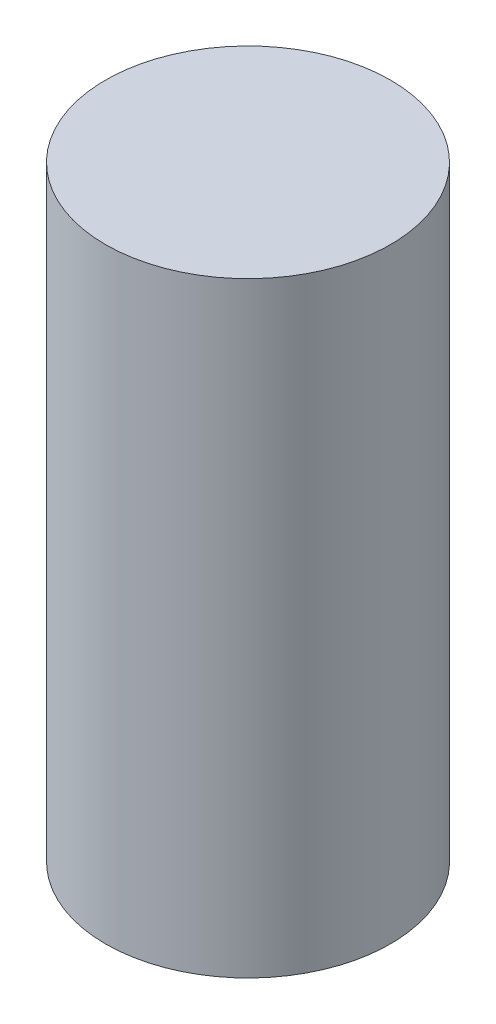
from build123d import *

# Parameters (mm, degrees)
SKETCH_1_R      = 20
EXTRUDE_1_DEPTH = 85


with BuildPart() as part:
    # Sketch 1 → Extrude 1 (new body)
    with BuildSketch(Plane(origin=(0, 0, 0), x_dir=(1, 0, 0), z_dir=(0, 1, 0))):
        with Locations(Location((0, 0, 0), (0, 0, 270))):
            Circle(SKETCH_1_R)
    extrude(amount=EXTRUDE_1_DEPTH)


solid = part.part
